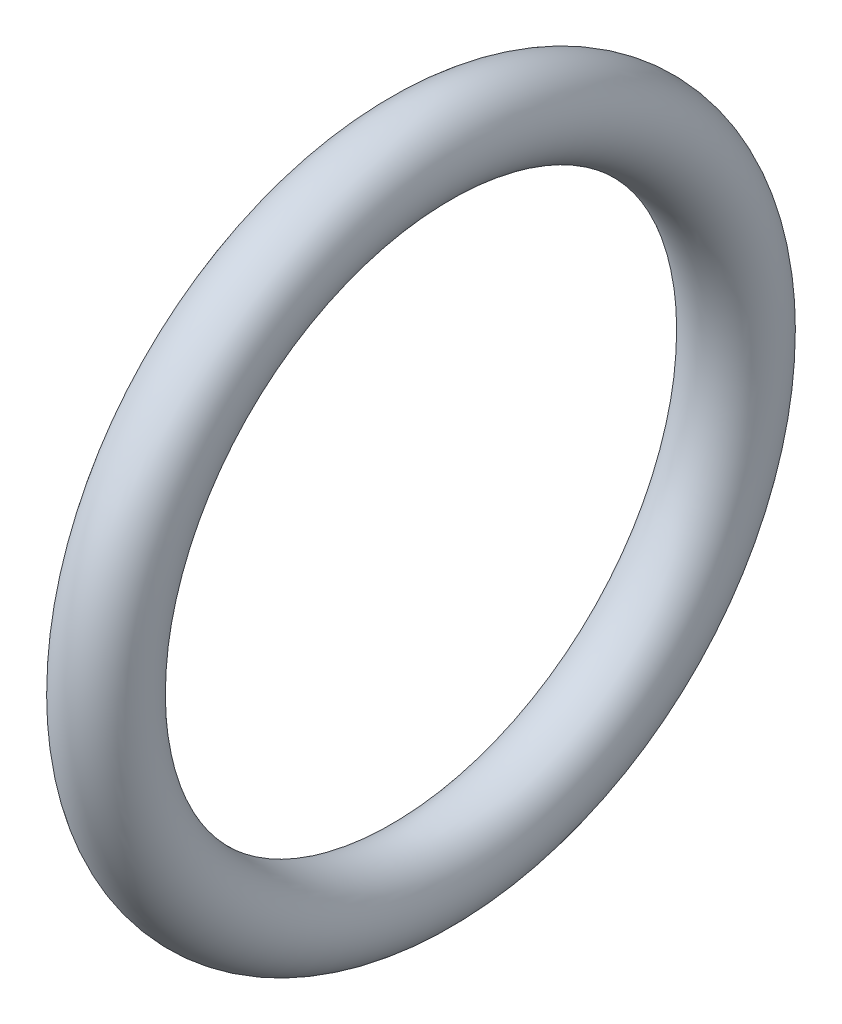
from build123d import *

# Parameters (mm, degrees)
ESQUISSE1_R = 1


with BuildPart() as part:
    # Esquisse1 → R_volution1 (revolve)
    with BuildSketch(Plane.XY, mode=Mode.PRIVATE) as r_volution1_sk:
        with Locations((-26.135384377, 6.180511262)):
            Circle(ESQUISSE1_R)
    revolve(r_volution1_sk.sketch.rotate(Axis((-29.148115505, -1.319488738, 0), (1, 0, 0)), 90), axis=Axis((-29.148115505, -1.319488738, 0), (1, 0, 0)))


solid = part.part
